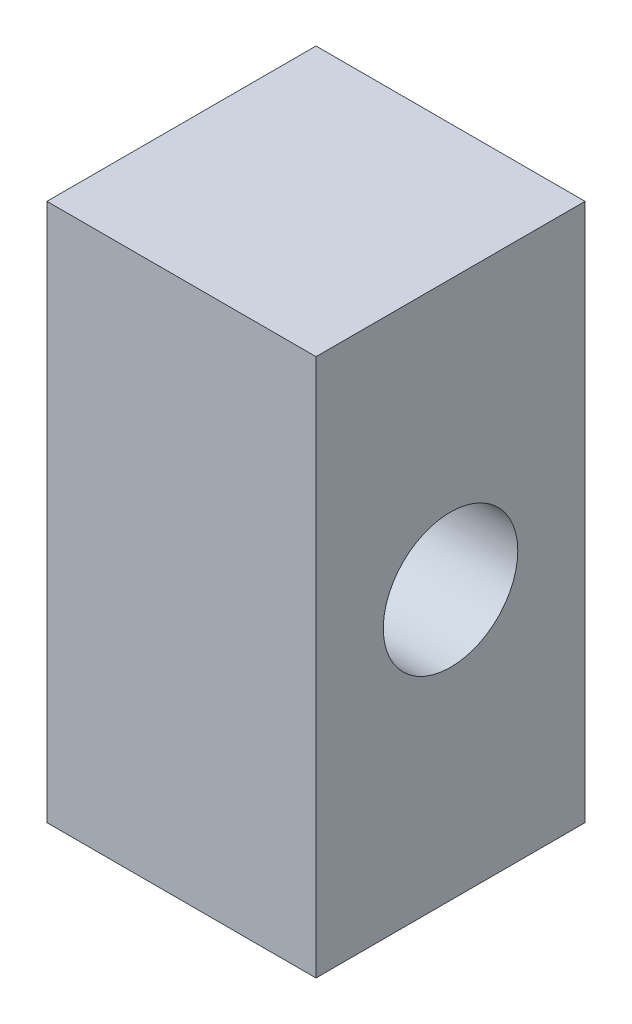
from build123d import *

# Parameters (mm, degrees)
SCHIZZO1_W                   = 40
SCHIZZO1_H                   = 80
ESTRUSIONE_ESTRUSIONE1_DEPTH = 20
SCHIZZO2_R                   = 10
TAGLIO_ESTRUSIONE1_DEPTH     = 40


with BuildPart() as part:
    # Schizzo1 → Estrusione-Estrusione1 (new, symmetric)
    with BuildSketch(Plane.XY):
        Rectangle(SCHIZZO1_W, SCHIZZO1_H)
    extrude(amount=ESTRUSIONE_ESTRUSIONE1_DEPTH, both=True)

    # Schizzo2 → Taglio-Estrusione1 (cut)
    with BuildSketch(Plane(origin=(20, 0, 0), x_dir=(0, 0, -1), z_dir=(1, 0, 0))):
        Circle(SCHIZZO2_R)
    extrude(amount=-TAGLIO_ESTRUSIONE1_DEPTH, mode=Mode.SUBTRACT)


solid = part.part
